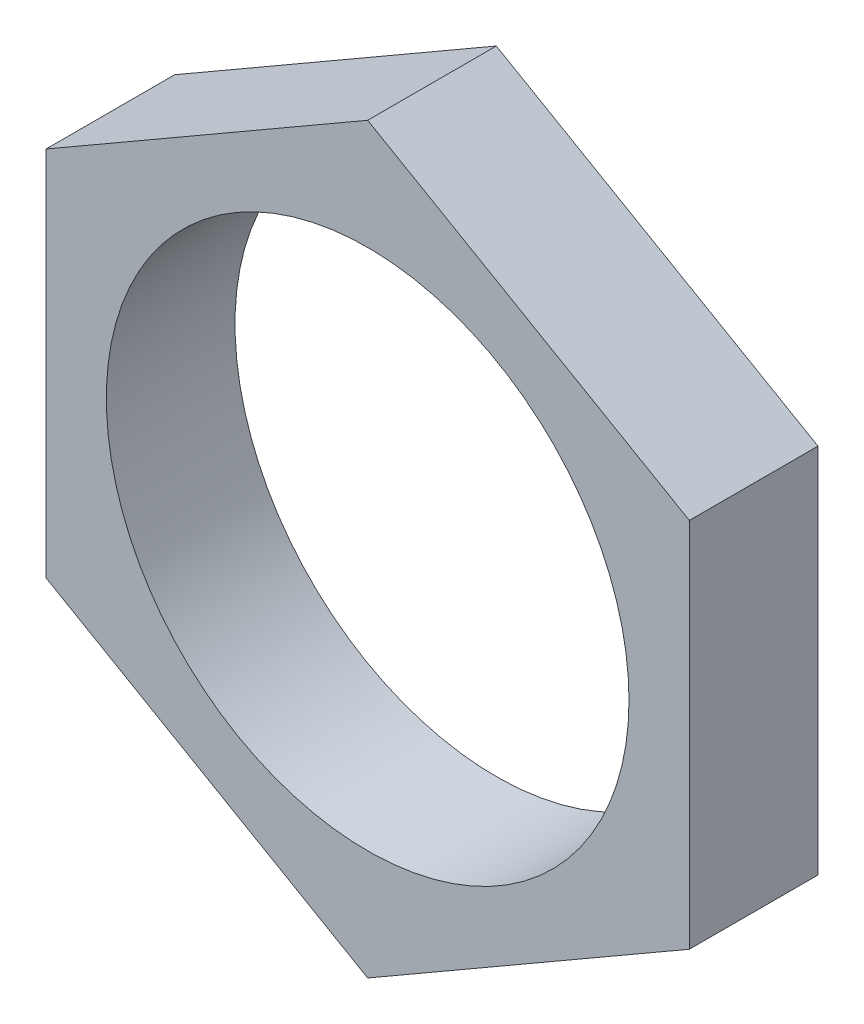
ISO-10303-21;
HEADER;
FILE_DESCRIPTION(('STEP AP214'),'2;1');
FILE_NAME('part.step','',(''),(''),'','','');
FILE_SCHEMA(('AUTOMOTIVE_DESIGN { 1 0 10303 214 1 1 1 1 }'));
ENDSEC;
DATA;
#1=APPLICATION_CONTEXT('core data for automotive mechanical design processes');
#2=APPLICATION_PROTOCOL_DEFINITION('international standard','automotive_design',2000,#1);
#3=PRODUCT_CONTEXT('',#1,'mechanical');
#4=PRODUCT('Part','Part','',(#3));
#5=PRODUCT_RELATED_PRODUCT_CATEGORY('part','',(#4));
#6=PRODUCT_DEFINITION_FORMATION('','',#4);
#7=PRODUCT_DEFINITION_CONTEXT('part definition',#1,'design');
#8=PRODUCT_DEFINITION('design','',#6,#7);
#9=PRODUCT_DEFINITION_SHAPE('','',#8);
#10=(LENGTH_UNIT() NAMED_UNIT(*) SI_UNIT(.MILLI.,.METRE.));
#11=(NAMED_UNIT(*) PLANE_ANGLE_UNIT() SI_UNIT($,.RADIAN.));
#12=(NAMED_UNIT(*) SI_UNIT($,.STERADIAN.) SOLID_ANGLE_UNIT());
#13=UNCERTAINTY_MEASURE_WITH_UNIT(LENGTH_MEASURE(1.E-05),#10,'distance_accuracy_value','');
#14=(GEOMETRIC_REPRESENTATION_CONTEXT(3) GLOBAL_UNCERTAINTY_ASSIGNED_CONTEXT((#13)) GLOBAL_UNIT_ASSIGNED_CONTEXT((#10,
#11,#12)) REPRESENTATION_CONTEXT('',''));
#15=CARTESIAN_POINT('',(0.,0.,0.));
#16=DIRECTION('',(0.,0.,1.));
#17=DIRECTION('',(1.,0.,0.));
#18=AXIS2_PLACEMENT_3D('',#15,#16,#17);
#19=CARTESIAN_POINT('',(-20.,-11.5470053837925,8.));
#20=DIRECTION('',(0.,0.,1.));
#21=DIRECTION('',(1.,0.,0.));
#22=AXIS2_PLACEMENT_3D('',#19,#20,#21);
#23=PLANE('',#22);
#24=DIRECTION('',(0.,-1.,0.));
#25=VECTOR('',#24,1.);
#26=CARTESIAN_POINT('',(-20.,11.5470053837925,8.));
#27=LINE('',#26,#25);
#28=CARTESIAN_POINT('',(-20.,11.5470053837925,8.));
#29=VERTEX_POINT('',#28);
#30=CARTESIAN_POINT('',(-20.,-11.5470053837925,8.));
#31=VERTEX_POINT('',#30);
#32=EDGE_CURVE('E134',#29,#31,#27,.T.);
#33=ORIENTED_EDGE('',*,*,#32,.T.);
#34=DIRECTION('',(0.866025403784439,-0.5,0.));
#35=VECTOR('',#34,1.);
#36=CARTESIAN_POINT('',(-20.,-11.5470053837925,8.));
#37=LINE('',#36,#35);
#38=CARTESIAN_POINT('',(0.,-23.094010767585,8.));
#39=VERTEX_POINT('',#38);
#40=EDGE_CURVE('E92',#31,#39,#37,.T.);
#41=ORIENTED_EDGE('',*,*,#40,.T.);
#42=DIRECTION('',(0.866025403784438,0.5,0.));
#43=VECTOR('',#42,1.);
#44=CARTESIAN_POINT('',(0.,-23.094010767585,8.));
#45=LINE('',#44,#43);
#46=CARTESIAN_POINT('',(20.,-11.5470053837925,8.));
#47=VERTEX_POINT('',#46);
#48=EDGE_CURVE('E105',#39,#47,#45,.T.);
#49=ORIENTED_EDGE('',*,*,#48,.T.);
#50=DIRECTION('',(0.,1.,0.));
#51=VECTOR('',#50,1.);
#52=CARTESIAN_POINT('',(20.,-11.5470053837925,8.));
#53=LINE('',#52,#51);
#54=CARTESIAN_POINT('',(20.,11.5470053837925,8.));
#55=VERTEX_POINT('',#54);
#56=EDGE_CURVE('E99',#47,#55,#53,.T.);
#57=ORIENTED_EDGE('',*,*,#56,.T.);
#58=DIRECTION('',(-0.866025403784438,0.5,0.));
#59=VECTOR('',#58,1.);
#60=CARTESIAN_POINT('',(20.,11.5470053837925,8.));
#61=LINE('',#60,#59);
#62=CARTESIAN_POINT('',(0.,23.094010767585,8.));
#63=VERTEX_POINT('',#62);
#64=EDGE_CURVE('E103',#55,#63,#61,.T.);
#65=ORIENTED_EDGE('',*,*,#64,.T.);
#66=DIRECTION('',(-0.866025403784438,-0.5,0.));
#67=VECTOR('',#66,1.);
#68=CARTESIAN_POINT('',(0.,23.094010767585,8.));
#69=LINE('',#68,#67);
#70=EDGE_CURVE('E55',#63,#29,#69,.T.);
#71=ORIENTED_EDGE('',*,*,#70,.T.);
#72=EDGE_LOOP('',(#33,#41,#49,#57,#65,#71));
#73=FACE_BOUND('',#72,.T.);
#74=CARTESIAN_POINT('',(0.,0.,8.));
#75=DIRECTION('',(0.,0.,1.));
#76=DIRECTION('',(1.,0.,0.));
#77=AXIS2_PLACEMENT_3D('',#74,#75,#76);
#78=CIRCLE('',#77,16.25);
#79=CARTESIAN_POINT('',(16.25,0.,8.));
#80=VERTEX_POINT('',#79);
#81=EDGE_CURVE('E127',#80,#80,#78,.T.);
#82=ORIENTED_EDGE('',*,*,#81,.F.);
#83=EDGE_LOOP('',(#82));
#84=FACE_BOUND('',#83,.T.);
#85=ADVANCED_FACE('F38',(#73,#84),#23,.T.);
#86=CARTESIAN_POINT('',(-20.,-11.5470053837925,0.));
#87=DIRECTION('',(0.,0.,1.));
#88=DIRECTION('',(1.,0.,0.));
#89=AXIS2_PLACEMENT_3D('',#86,#87,#88);
#90=PLANE('',#89);
#91=DIRECTION('',(0.,-1.,0.));
#92=VECTOR('',#91,1.);
#93=CARTESIAN_POINT('',(-20.,11.5470053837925,0.));
#94=LINE('',#93,#92);
#95=CARTESIAN_POINT('',(-20.,11.5470053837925,0.));
#96=VERTEX_POINT('',#95);
#97=CARTESIAN_POINT('',(-20.,-11.5470053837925,0.));
#98=VERTEX_POINT('',#97);
#99=EDGE_CURVE('E123',#96,#98,#94,.T.);
#100=ORIENTED_EDGE('',*,*,#99,.F.);
#101=DIRECTION('',(-0.866025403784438,-0.5,0.));
#102=VECTOR('',#101,1.);
#103=CARTESIAN_POINT('',(0.,23.094010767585,0.));
#104=LINE('',#103,#102);
#105=CARTESIAN_POINT('',(0.,23.094010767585,0.));
#106=VERTEX_POINT('',#105);
#107=EDGE_CURVE('E84',#106,#96,#104,.T.);
#108=ORIENTED_EDGE('',*,*,#107,.F.);
#109=DIRECTION('',(-0.866025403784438,0.5,0.));
#110=VECTOR('',#109,1.);
#111=CARTESIAN_POINT('',(20.,11.5470053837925,0.));
#112=LINE('',#111,#110);
#113=CARTESIAN_POINT('',(20.,11.5470053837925,0.));
#114=VERTEX_POINT('',#113);
#115=EDGE_CURVE('E78',#114,#106,#112,.T.);
#116=ORIENTED_EDGE('',*,*,#115,.F.);
#117=DIRECTION('',(0.,1.,0.));
#118=VECTOR('',#117,1.);
#119=CARTESIAN_POINT('',(20.,-11.5470053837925,0.));
#120=LINE('',#119,#118);
#121=CARTESIAN_POINT('',(20.,-11.5470053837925,0.));
#122=VERTEX_POINT('',#121);
#123=EDGE_CURVE('E113',#122,#114,#120,.T.);
#124=ORIENTED_EDGE('',*,*,#123,.F.);
#125=DIRECTION('',(0.866025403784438,0.5,0.));
#126=VECTOR('',#125,1.);
#127=CARTESIAN_POINT('',(0.,-23.094010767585,0.));
#128=LINE('',#127,#126);
#129=CARTESIAN_POINT('',(0.,-23.094010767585,0.));
#130=VERTEX_POINT('',#129);
#131=EDGE_CURVE('E129',#130,#122,#128,.T.);
#132=ORIENTED_EDGE('',*,*,#131,.F.);
#133=DIRECTION('',(0.866025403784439,-0.5,0.));
#134=VECTOR('',#133,1.);
#135=CARTESIAN_POINT('',(-20.,-11.5470053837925,0.));
#136=LINE('',#135,#134);
#137=EDGE_CURVE('E126',#98,#130,#136,.T.);
#138=ORIENTED_EDGE('',*,*,#137,.F.);
#139=EDGE_LOOP('',(#100,#108,#116,#124,#132,#138));
#140=FACE_BOUND('',#139,.T.);
#141=CARTESIAN_POINT('',(0.,0.,0.));
#142=DIRECTION('',(0.,0.,1.));
#143=DIRECTION('',(1.,0.,0.));
#144=AXIS2_PLACEMENT_3D('',#141,#142,#143);
#145=CIRCLE('',#144,16.25);
#146=CARTESIAN_POINT('',(16.25,0.,0.));
#147=VERTEX_POINT('',#146);
#148=EDGE_CURVE('E247',#147,#147,#145,.T.);
#149=ORIENTED_EDGE('',*,*,#148,.T.);
#150=EDGE_LOOP('',(#149));
#151=FACE_BOUND('',#150,.T.);
#152=ADVANCED_FACE('F143',(#140,#151),#90,.F.);
#153=CARTESIAN_POINT('',(-20.,11.5470053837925,8.));
#154=DIRECTION('',(1.,0.,0.));
#155=DIRECTION('',(0.,0.,-1.));
#156=AXIS2_PLACEMENT_3D('',#153,#154,#155);
#157=PLANE('',#156);
#158=ORIENTED_EDGE('',*,*,#99,.T.);
#159=DIRECTION('',(0.,0.,-1.));
#160=VECTOR('',#159,1.);
#161=CARTESIAN_POINT('',(-20.,-11.5470053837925,8.));
#162=LINE('',#161,#160);
#163=EDGE_CURVE('E11',#31,#98,#162,.T.);
#164=ORIENTED_EDGE('',*,*,#163,.F.);
#165=ORIENTED_EDGE('',*,*,#32,.F.);
#166=DIRECTION('',(0.,0.,-1.));
#167=VECTOR('',#166,1.);
#168=CARTESIAN_POINT('',(-20.,11.5470053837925,8.));
#169=LINE('',#168,#167);
#170=EDGE_CURVE('E119',#29,#96,#169,.T.);
#171=ORIENTED_EDGE('',*,*,#170,.T.);
#172=EDGE_LOOP('',(#158,#164,#165,#171));
#173=FACE_BOUND('',#172,.T.);
#174=ADVANCED_FACE('F40',(#173),#157,.F.);
#175=CARTESIAN_POINT('',(-20.,-11.5470053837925,8.));
#176=DIRECTION('',(0.5,0.866025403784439,0.));
#177=DIRECTION('',(-0.866025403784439,0.5,0.));
#178=AXIS2_PLACEMENT_3D('',#175,#176,#177);
#179=PLANE('',#178);
#180=ORIENTED_EDGE('',*,*,#137,.T.);
#181=DIRECTION('',(0.,0.,-1.));
#182=VECTOR('',#181,1.);
#183=CARTESIAN_POINT('',(0.,-23.094010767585,8.));
#184=LINE('',#183,#182);
#185=EDGE_CURVE('E47',#39,#130,#184,.T.);
#186=ORIENTED_EDGE('',*,*,#185,.F.);
#187=ORIENTED_EDGE('',*,*,#40,.F.);
#188=ORIENTED_EDGE('',*,*,#163,.T.);
#189=EDGE_LOOP('',(#180,#186,#187,#188));
#190=FACE_BOUND('',#189,.T.);
#191=ADVANCED_FACE('F168',(#190),#179,.F.);
#192=CARTESIAN_POINT('',(0.,-23.094010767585,8.));
#193=DIRECTION('',(-0.5,0.866025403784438,0.));
#194=DIRECTION('',(-0.866025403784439,-0.5,0.));
#195=AXIS2_PLACEMENT_3D('',#192,#193,#194);
#196=PLANE('',#195);
#197=ORIENTED_EDGE('',*,*,#131,.T.);
#198=DIRECTION('',(0.,0.,-1.));
#199=VECTOR('',#198,1.);
#200=CARTESIAN_POINT('',(20.,-11.5470053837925,8.));
#201=LINE('',#200,#199);
#202=EDGE_CURVE('E114',#47,#122,#201,.T.);
#203=ORIENTED_EDGE('',*,*,#202,.F.);
#204=ORIENTED_EDGE('',*,*,#48,.F.);
#205=ORIENTED_EDGE('',*,*,#185,.T.);
#206=EDGE_LOOP('',(#197,#203,#204,#205));
#207=FACE_BOUND('',#206,.T.);
#208=ADVANCED_FACE('F140',(#207),#196,.F.);
#209=CARTESIAN_POINT('',(20.,-11.5470053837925,8.));
#210=DIRECTION('',(-1.,0.,0.));
#211=DIRECTION('',(0.,-1.,0.));
#212=AXIS2_PLACEMENT_3D('',#209,#210,#211);
#213=PLANE('',#212);
#214=ORIENTED_EDGE('',*,*,#123,.T.);
#215=DIRECTION('',(0.,0.,-1.));
#216=VECTOR('',#215,1.);
#217=CARTESIAN_POINT('',(20.,11.5470053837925,8.));
#218=LINE('',#217,#216);
#219=EDGE_CURVE('E110',#55,#114,#218,.T.);
#220=ORIENTED_EDGE('',*,*,#219,.F.);
#221=ORIENTED_EDGE('',*,*,#56,.F.);
#222=ORIENTED_EDGE('',*,*,#202,.T.);
#223=EDGE_LOOP('',(#214,#220,#221,#222));
#224=FACE_BOUND('',#223,.T.);
#225=ADVANCED_FACE('F111',(#224),#213,.F.);
#226=CARTESIAN_POINT('',(20.,11.5470053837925,8.));
#227=DIRECTION('',(-0.5,-0.866025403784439,0.));
#228=DIRECTION('',(0.866025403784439,-0.5,0.));
#229=AXIS2_PLACEMENT_3D('',#226,#227,#228);
#230=PLANE('',#229);
#231=ORIENTED_EDGE('',*,*,#115,.T.);
#232=DIRECTION('',(0.,0.,-1.));
#233=VECTOR('',#232,1.);
#234=CARTESIAN_POINT('',(0.,23.094010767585,8.));
#235=LINE('',#234,#233);
#236=EDGE_CURVE('E115',#63,#106,#235,.T.);
#237=ORIENTED_EDGE('',*,*,#236,.F.);
#238=ORIENTED_EDGE('',*,*,#64,.F.);
#239=ORIENTED_EDGE('',*,*,#219,.T.);
#240=EDGE_LOOP('',(#231,#237,#238,#239));
#241=FACE_BOUND('',#240,.T.);
#242=ADVANCED_FACE('F117',(#241),#230,.F.);
#243=CARTESIAN_POINT('',(0.,23.094010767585,8.));
#244=DIRECTION('',(0.5,-0.866025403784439,0.));
#245=DIRECTION('',(0.866025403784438,0.5,0.));
#246=AXIS2_PLACEMENT_3D('',#243,#244,#245);
#247=PLANE('',#246);
#248=ORIENTED_EDGE('',*,*,#107,.T.);
#249=ORIENTED_EDGE('',*,*,#170,.F.);
#250=ORIENTED_EDGE('',*,*,#70,.F.);
#251=ORIENTED_EDGE('',*,*,#236,.T.);
#252=EDGE_LOOP('',(#248,#249,#250,#251));
#253=FACE_BOUND('',#252,.T.);
#254=ADVANCED_FACE('F148',(#253),#247,.F.);
#255=CARTESIAN_POINT('',(0.,0.,8.));
#256=DIRECTION('',(0.,0.,-1.));
#257=DIRECTION('',(-1.,0.,0.));
#258=AXIS2_PLACEMENT_3D('',#255,#256,#257);
#259=CYLINDRICAL_SURFACE('',#258,16.25);
#260=ORIENTED_EDGE('',*,*,#81,.T.);
#261=EDGE_LOOP('',(#260));
#262=FACE_BOUND('',#261,.T.);
#263=ORIENTED_EDGE('',*,*,#148,.F.);
#264=EDGE_LOOP('',(#263));
#265=FACE_BOUND('',#264,.T.);
#266=ADVANCED_FACE('F150',(#262,#265),#259,.F.);
#267=CLOSED_SHELL('',(#85,#152,#174,#191,#208,#225,#242,#254,#266));
#268=MANIFOLD_SOLID_BREP('B2',#267);
#269=ADVANCED_BREP_SHAPE_REPRESENTATION('',(#18,#268),#14);
#270=SHAPE_DEFINITION_REPRESENTATION(#9,#269);
ENDSEC;
END-ISO-10303-21;
